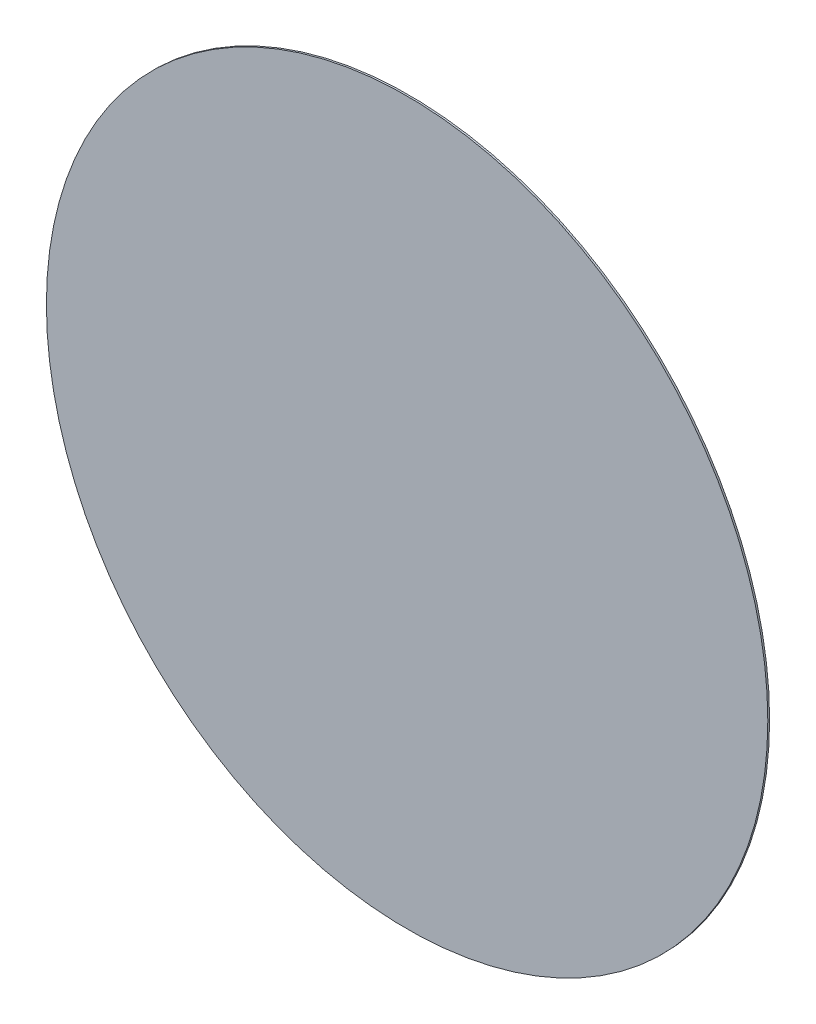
ISO-10303-21;
HEADER;
FILE_DESCRIPTION(('STEP AP214'),'2;1');
FILE_NAME('part.step','',(''),(''),'','','');
FILE_SCHEMA(('AUTOMOTIVE_DESIGN { 1 0 10303 214 1 1 1 1 }'));
ENDSEC;
DATA;
#1=APPLICATION_CONTEXT('core data for automotive mechanical design processes');
#2=APPLICATION_PROTOCOL_DEFINITION('international standard','automotive_design',2000,#1);
#3=PRODUCT_CONTEXT('',#1,'mechanical');
#4=PRODUCT('Part','Part','',(#3));
#5=PRODUCT_RELATED_PRODUCT_CATEGORY('part','',(#4));
#6=PRODUCT_DEFINITION_FORMATION('','',#4);
#7=PRODUCT_DEFINITION_CONTEXT('part definition',#1,'design');
#8=PRODUCT_DEFINITION('design','',#6,#7);
#9=PRODUCT_DEFINITION_SHAPE('','',#8);
#10=(LENGTH_UNIT() NAMED_UNIT(*) SI_UNIT(.MILLI.,.METRE.));
#11=(NAMED_UNIT(*) PLANE_ANGLE_UNIT() SI_UNIT($,.RADIAN.));
#12=(NAMED_UNIT(*) SI_UNIT($,.STERADIAN.) SOLID_ANGLE_UNIT());
#13=UNCERTAINTY_MEASURE_WITH_UNIT(LENGTH_MEASURE(1.E-05),#10,'distance_accuracy_value','');
#14=(GEOMETRIC_REPRESENTATION_CONTEXT(3) GLOBAL_UNCERTAINTY_ASSIGNED_CONTEXT((#13)) GLOBAL_UNIT_ASSIGNED_CONTEXT((#10,
#11,#12)) REPRESENTATION_CONTEXT('',''));
#15=CARTESIAN_POINT('',(0.,0.,0.));
#16=DIRECTION('',(0.,0.,1.));
#17=DIRECTION('',(1.,0.,0.));
#18=AXIS2_PLACEMENT_3D('',#15,#16,#17);
#19=CARTESIAN_POINT('',(-465.937225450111,-349.960393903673,-154.0047981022));
#20=DIRECTION('',(0.,0.,1.));
#21=DIRECTION('',(1.,0.,0.));
#22=AXIS2_PLACEMENT_3D('',#19,#20,#21);
#23=PLANE('',#22);
#24=DIRECTION('',(0.,1.,0.));
#25=VECTOR('',#24,1.);
#26=CARTESIAN_POINT('',(-465.187225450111,-343.210393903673,-154.0047981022));
#27=LINE('',#26,#25);
#28=CARTESIAN_POINT('',(-465.187225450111,-343.210393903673,-154.0047981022));
#29=VERTEX_POINT('',#28);
#30=CARTESIAN_POINT('',(-465.187225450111,-349.210393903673,-154.0047981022));
#31=VERTEX_POINT('',#30);
#32=EDGE_CURVE('E151',#29,#31,#27,.F.);
#33=ORIENTED_EDGE('',*,*,#32,.T.);
#34=DIRECTION('',(-1.,0.,0.));
#35=VECTOR('',#34,1.);
#36=CARTESIAN_POINT('',(-465.187225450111,-349.210393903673,-154.0047981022));
#37=LINE('',#36,#35);
#38=CARTESIAN_POINT('',(-458.937225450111,-349.210393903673,-154.0047981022));
#39=VERTEX_POINT('',#38);
#40=EDGE_CURVE('E259',#31,#39,#37,.F.);
#41=ORIENTED_EDGE('',*,*,#40,.T.);
#42=DIRECTION('',(0.,1.,0.));
#43=VECTOR('',#42,1.);
#44=CARTESIAN_POINT('',(-458.937225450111,-349.210393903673,-154.0047981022));
#45=LINE('',#44,#43);
#46=CARTESIAN_POINT('',(-458.937225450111,-350.710393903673,-154.0047981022));
#47=VERTEX_POINT('',#46);
#48=EDGE_CURVE('E254',#39,#47,#45,.F.);
#49=ORIENTED_EDGE('',*,*,#48,.T.);
#50=DIRECTION('',(1.,0.,0.));
#51=VECTOR('',#50,1.);
#52=CARTESIAN_POINT('',(-458.937225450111,-350.710393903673,-154.0047981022));
#53=LINE('',#52,#51);
#54=CARTESIAN_POINT('',(-472.937225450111,-350.710393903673,-154.0047981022));
#55=VERTEX_POINT('',#54);
#56=EDGE_CURVE('E249',#47,#55,#53,.F.);
#57=ORIENTED_EDGE('',*,*,#56,.T.);
#58=DIRECTION('',(0.,-1.,0.));
#59=VECTOR('',#58,1.);
#60=CARTESIAN_POINT('',(-472.937225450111,-350.710393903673,-154.0047981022));
#61=LINE('',#60,#59);
#62=CARTESIAN_POINT('',(-472.937225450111,-349.210393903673,-154.0047981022));
#63=VERTEX_POINT('',#62);
#64=EDGE_CURVE('E244',#55,#63,#61,.F.);
#65=ORIENTED_EDGE('',*,*,#64,.T.);
#66=DIRECTION('',(-1.,0.,0.));
#67=VECTOR('',#66,1.);
#68=CARTESIAN_POINT('',(-465.187225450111,-349.210393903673,-154.0047981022));
#69=LINE('',#68,#67);
#70=CARTESIAN_POINT('',(-466.687225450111,-349.210393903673,-154.0047981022));
#71=VERTEX_POINT('',#70);
#72=EDGE_CURVE('E134',#63,#71,#69,.F.);
#73=ORIENTED_EDGE('',*,*,#72,.T.);
#74=DIRECTION('',(0.,-1.,0.));
#75=VECTOR('',#74,1.);
#76=CARTESIAN_POINT('',(-466.687225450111,-349.210393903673,-154.0047981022));
#77=LINE('',#76,#75);
#78=CARTESIAN_POINT('',(-466.687225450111,-343.210393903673,-154.0047981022));
#79=VERTEX_POINT('',#78);
#80=EDGE_CURVE('E131',#71,#79,#77,.F.);
#81=ORIENTED_EDGE('',*,*,#80,.T.);
#82=DIRECTION('',(-1.,0.,0.));
#83=VECTOR('',#82,1.);
#84=CARTESIAN_POINT('',(-466.687225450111,-343.210393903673,-154.0047981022));
#85=LINE('',#84,#83);
#86=EDGE_CURVE('E128',#79,#29,#85,.F.);
#87=ORIENTED_EDGE('',*,*,#86,.T.);
#88=EDGE_LOOP('',(#33,#41,#49,#57,#65,#73,#81,#87));
#89=FACE_BOUND('',#88,.T.);
#90=ADVANCED_FACE('F17',(#89),#23,.F.);
#91=CARTESIAN_POINT('',(-465.937225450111,-349.960393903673,-154.0047981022));
#92=DIRECTION('',(0.,0.,1.));
#93=DIRECTION('',(1.,0.,0.));
#94=AXIS2_PLACEMENT_3D('',#91,#92,#93);
#95=PLANE('',#94);
#96=DIRECTION('',(1.,0.,0.));
#97=VECTOR('',#96,1.);
#98=CARTESIAN_POINT('',(-464.187225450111,-356.910393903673,-154.0047981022));
#99=LINE('',#98,#97);
#100=CARTESIAN_POINT('',(-464.187225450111,-356.910393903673,-154.0047981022));
#101=VERTEX_POINT('',#100);
#102=CARTESIAN_POINT('',(-467.687225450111,-356.910393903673,-154.0047981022));
#103=VERTEX_POINT('',#102);
#104=EDGE_CURVE('E231',#101,#103,#99,.F.);
#105=ORIENTED_EDGE('',*,*,#104,.T.);
#106=DIRECTION('',(0.,-1.,0.));
#107=VECTOR('',#106,1.);
#108=CARTESIAN_POINT('',(-467.687225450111,-356.910393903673,-154.0047981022));
#109=LINE('',#108,#107);
#110=CARTESIAN_POINT('',(-467.687225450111,-355.410393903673,-154.0047981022));
#111=VERTEX_POINT('',#110);
#112=EDGE_CURVE('E226',#103,#111,#109,.F.);
#113=ORIENTED_EDGE('',*,*,#112,.T.);
#114=DIRECTION('',(-1.,0.,0.));
#115=VECTOR('',#114,1.);
#116=CARTESIAN_POINT('',(-467.687225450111,-355.410393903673,-154.0047981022));
#117=LINE('',#116,#115);
#118=CARTESIAN_POINT('',(-464.187225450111,-355.410393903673,-154.0047981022));
#119=VERTEX_POINT('',#118);
#120=EDGE_CURVE('E221',#111,#119,#117,.F.);
#121=ORIENTED_EDGE('',*,*,#120,.T.);
#122=DIRECTION('',(0.,1.,0.));
#123=VECTOR('',#122,1.);
#124=CARTESIAN_POINT('',(-464.187225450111,-355.410393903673,-154.0047981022));
#125=LINE('',#124,#123);
#126=EDGE_CURVE('E236',#119,#101,#125,.F.);
#127=ORIENTED_EDGE('',*,*,#126,.T.);
#128=EDGE_LOOP('',(#105,#113,#121,#127));
#129=FACE_BOUND('',#128,.T.);
#130=ADVANCED_FACE('F551',(#129),#95,.F.);
#131=CARTESIAN_POINT('',(-465.937225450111,-349.960393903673,-154.0047981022));
#132=DIRECTION('',(0.,0.,1.));
#133=DIRECTION('',(1.,0.,0.));
#134=AXIS2_PLACEMENT_3D('',#131,#132,#133);
#135=PLANE('',#134);
#136=DIRECTION('',(1.,0.,0.));
#137=VECTOR('',#136,1.);
#138=CARTESIAN_POINT('',(-460.937225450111,-353.810393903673,-154.0047981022));
#139=LINE('',#138,#137);
#140=CARTESIAN_POINT('',(-460.937225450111,-353.810393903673,-154.0047981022));
#141=VERTEX_POINT('',#140);
#142=CARTESIAN_POINT('',(-470.937225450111,-353.810393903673,-154.0047981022));
#143=VERTEX_POINT('',#142);
#144=EDGE_CURVE('E212',#141,#143,#139,.F.);
#145=ORIENTED_EDGE('',*,*,#144,.T.);
#146=DIRECTION('',(0.,-1.,0.));
#147=VECTOR('',#146,1.);
#148=CARTESIAN_POINT('',(-470.937225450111,-353.810393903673,-154.0047981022));
#149=LINE('',#148,#147);
#150=CARTESIAN_POINT('',(-470.937225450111,-352.310393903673,-154.0047981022));
#151=VERTEX_POINT('',#150);
#152=EDGE_CURVE('E207',#143,#151,#149,.F.);
#153=ORIENTED_EDGE('',*,*,#152,.T.);
#154=DIRECTION('',(-1.,0.,0.));
#155=VECTOR('',#154,1.);
#156=CARTESIAN_POINT('',(-470.937225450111,-352.310393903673,-154.0047981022));
#157=LINE('',#156,#155);
#158=CARTESIAN_POINT('',(-460.937225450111,-352.310393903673,-154.0047981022));
#159=VERTEX_POINT('',#158);
#160=EDGE_CURVE('E203',#151,#159,#157,.F.);
#161=ORIENTED_EDGE('',*,*,#160,.T.);
#162=DIRECTION('',(0.,1.,0.));
#163=VECTOR('',#162,1.);
#164=CARTESIAN_POINT('',(-460.937225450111,-352.310393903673,-154.0047981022));
#165=LINE('',#164,#163);
#166=EDGE_CURVE('E217',#159,#141,#165,.F.);
#167=ORIENTED_EDGE('',*,*,#166,.T.);
#168=EDGE_LOOP('',(#145,#153,#161,#167));
#169=FACE_BOUND('',#168,.T.);
#170=ADVANCED_FACE('F540',(#169),#135,.F.);
#171=CARTESIAN_POINT('',(-466.687225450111,-349.210393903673,-182.339246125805));
#172=DIRECTION('',(-1.,0.,0.));
#173=DIRECTION('',(0.,-1.,0.));
#174=AXIS2_PLACEMENT_3D('',#171,#172,#173);
#175=PLANE('',#174);
#176=DIRECTION('',(0.,0.,1.));
#177=VECTOR('',#176,1.);
#178=CARTESIAN_POINT('',(-466.687225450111,-343.210393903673,-182.339246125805));
#179=LINE('',#178,#177);
#180=CARTESIAN_POINT('',(-466.687225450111,-343.210393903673,-154.0547981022));
#181=VERTEX_POINT('',#180);
#182=EDGE_CURVE('E137',#181,#79,#179,.T.);
#183=ORIENTED_EDGE('',*,*,#182,.T.);
#184=ORIENTED_EDGE('',*,*,#80,.F.);
#185=DIRECTION('',(0.,0.,1.));
#186=VECTOR('',#185,1.);
#187=CARTESIAN_POINT('',(-466.687225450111,-349.210393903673,-182.339246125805));
#188=LINE('',#187,#186);
#189=CARTESIAN_POINT('',(-466.687225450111,-349.210393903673,-154.0547981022));
#190=VERTEX_POINT('',#189);
#191=EDGE_CURVE('E238',#71,#190,#188,.F.);
#192=ORIENTED_EDGE('',*,*,#191,.T.);
#193=DIRECTION('',(0.,1.,0.));
#194=VECTOR('',#193,1.);
#195=CARTESIAN_POINT('',(-466.687225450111,-349.960393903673,-154.0547981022));
#196=LINE('',#195,#194);
#197=EDGE_CURVE('E142',#190,#181,#196,.T.);
#198=ORIENTED_EDGE('',*,*,#197,.T.);
#199=EDGE_LOOP('',(#183,#184,#192,#198));
#200=FACE_BOUND('',#199,.T.);
#201=ADVANCED_FACE('F140',(#200),#175,.F.);
#202=CARTESIAN_POINT('',(-466.687225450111,-343.210393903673,-182.339246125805));
#203=DIRECTION('',(0.,1.,0.));
#204=DIRECTION('',(-1.,0.,0.));
#205=AXIS2_PLACEMENT_3D('',#202,#203,#204);
#206=PLANE('',#205);
#207=DIRECTION('',(0.,0.,1.));
#208=VECTOR('',#207,1.);
#209=CARTESIAN_POINT('',(-465.187225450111,-343.210393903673,-182.339246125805));
#210=LINE('',#209,#208);
#211=CARTESIAN_POINT('',(-465.187225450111,-343.210393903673,-154.0547981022));
#212=VERTEX_POINT('',#211);
#213=EDGE_CURVE('E148',#212,#29,#210,.T.);
#214=ORIENTED_EDGE('',*,*,#213,.T.);
#215=ORIENTED_EDGE('',*,*,#86,.F.);
#216=ORIENTED_EDGE('',*,*,#182,.F.);
#217=DIRECTION('',(1.,0.,0.));
#218=VECTOR('',#217,1.);
#219=CARTESIAN_POINT('',(-465.937225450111,-343.210393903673,-154.0547981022));
#220=LINE('',#219,#218);
#221=EDGE_CURVE('E198',#181,#212,#220,.T.);
#222=ORIENTED_EDGE('',*,*,#221,.T.);
#223=EDGE_LOOP('',(#214,#215,#216,#222));
#224=FACE_BOUND('',#223,.T.);
#225=ADVANCED_FACE('F146',(#224),#206,.F.);
#226=CARTESIAN_POINT('',(-465.187225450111,-343.210393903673,-182.339246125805));
#227=DIRECTION('',(1.,0.,0.));
#228=DIRECTION('',(0.,1.,0.));
#229=AXIS2_PLACEMENT_3D('',#226,#227,#228);
#230=PLANE('',#229);
#231=DIRECTION('',(0.,0.,1.));
#232=VECTOR('',#231,1.);
#233=CARTESIAN_POINT('',(-465.187225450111,-349.210393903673,-182.339246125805));
#234=LINE('',#233,#232);
#235=CARTESIAN_POINT('',(-465.187225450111,-349.210393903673,-154.0547981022));
#236=VERTEX_POINT('',#235);
#237=EDGE_CURVE('E261',#236,#31,#234,.T.);
#238=ORIENTED_EDGE('',*,*,#237,.T.);
#239=ORIENTED_EDGE('',*,*,#32,.F.);
#240=ORIENTED_EDGE('',*,*,#213,.F.);
#241=DIRECTION('',(0.,1.,0.));
#242=VECTOR('',#241,1.);
#243=CARTESIAN_POINT('',(-465.187225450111,-349.960393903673,-154.0547981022));
#244=LINE('',#243,#242);
#245=EDGE_CURVE('E196',#212,#236,#244,.F.);
#246=ORIENTED_EDGE('',*,*,#245,.T.);
#247=EDGE_LOOP('',(#238,#239,#240,#246));
#248=FACE_BOUND('',#247,.T.);
#249=ADVANCED_FACE('F266',(#248),#230,.F.);
#250=CARTESIAN_POINT('',(-465.187225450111,-349.210393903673,-182.339246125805));
#251=DIRECTION('',(0.,1.,0.));
#252=DIRECTION('',(-1.,0.,0.));
#253=AXIS2_PLACEMENT_3D('',#250,#251,#252);
#254=PLANE('',#253);
#255=DIRECTION('',(0.,0.,1.));
#256=VECTOR('',#255,1.);
#257=CARTESIAN_POINT('',(-458.937225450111,-349.210393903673,-182.339246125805));
#258=LINE('',#257,#256);
#259=CARTESIAN_POINT('',(-458.937225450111,-349.210393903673,-154.0547981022));
#260=VERTEX_POINT('',#259);
#261=EDGE_CURVE('E256',#260,#39,#258,.T.);
#262=ORIENTED_EDGE('',*,*,#261,.T.);
#263=ORIENTED_EDGE('',*,*,#40,.F.);
#264=ORIENTED_EDGE('',*,*,#237,.F.);
#265=DIRECTION('',(1.,0.,0.));
#266=VECTOR('',#265,1.);
#267=CARTESIAN_POINT('',(-465.937225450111,-349.210393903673,-154.0547981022));
#268=LINE('',#267,#266);
#269=EDGE_CURVE('E194',#236,#260,#268,.T.);
#270=ORIENTED_EDGE('',*,*,#269,.T.);
#271=EDGE_LOOP('',(#262,#263,#264,#270));
#272=FACE_BOUND('',#271,.T.);
#273=ADVANCED_FACE('F270',(#272),#254,.F.);
#274=CARTESIAN_POINT('',(-458.937225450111,-349.210393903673,-182.339246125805));
#275=DIRECTION('',(1.,0.,0.));
#276=DIRECTION('',(0.,1.,0.));
#277=AXIS2_PLACEMENT_3D('',#274,#275,#276);
#278=PLANE('',#277);
#279=DIRECTION('',(0.,0.,1.));
#280=VECTOR('',#279,1.);
#281=CARTESIAN_POINT('',(-458.937225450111,-350.710393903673,-182.339246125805));
#282=LINE('',#281,#280);
#283=CARTESIAN_POINT('',(-458.937225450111,-350.710393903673,-154.0547981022));
#284=VERTEX_POINT('',#283);
#285=EDGE_CURVE('E251',#284,#47,#282,.T.);
#286=ORIENTED_EDGE('',*,*,#285,.T.);
#287=ORIENTED_EDGE('',*,*,#48,.F.);
#288=ORIENTED_EDGE('',*,*,#261,.F.);
#289=DIRECTION('',(0.,1.,0.));
#290=VECTOR('',#289,1.);
#291=CARTESIAN_POINT('',(-458.937225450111,-349.960393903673,-154.0547981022));
#292=LINE('',#291,#290);
#293=EDGE_CURVE('E192',#260,#284,#292,.F.);
#294=ORIENTED_EDGE('',*,*,#293,.T.);
#295=EDGE_LOOP('',(#286,#287,#288,#294));
#296=FACE_BOUND('',#295,.T.);
#297=ADVANCED_FACE('F275',(#296),#278,.F.);
#298=CARTESIAN_POINT('',(-458.937225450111,-350.710393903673,-182.339246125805));
#299=DIRECTION('',(0.,-1.,0.));
#300=DIRECTION('',(1.,0.,0.));
#301=AXIS2_PLACEMENT_3D('',#298,#299,#300);
#302=PLANE('',#301);
#303=DIRECTION('',(0.,0.,1.));
#304=VECTOR('',#303,1.);
#305=CARTESIAN_POINT('',(-472.937225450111,-350.710393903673,-182.339246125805));
#306=LINE('',#305,#304);
#307=CARTESIAN_POINT('',(-472.937225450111,-350.710393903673,-154.0547981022));
#308=VERTEX_POINT('',#307);
#309=EDGE_CURVE('E246',#308,#55,#306,.T.);
#310=ORIENTED_EDGE('',*,*,#309,.T.);
#311=ORIENTED_EDGE('',*,*,#56,.F.);
#312=ORIENTED_EDGE('',*,*,#285,.F.);
#313=DIRECTION('',(1.,0.,0.));
#314=VECTOR('',#313,1.);
#315=CARTESIAN_POINT('',(-465.937225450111,-350.710393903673,-154.0547981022));
#316=LINE('',#315,#314);
#317=EDGE_CURVE('E190',#284,#308,#316,.F.);
#318=ORIENTED_EDGE('',*,*,#317,.T.);
#319=EDGE_LOOP('',(#310,#311,#312,#318));
#320=FACE_BOUND('',#319,.T.);
#321=ADVANCED_FACE('F281',(#320),#302,.F.);
#322=CARTESIAN_POINT('',(-472.937225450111,-350.710393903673,-182.339246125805));
#323=DIRECTION('',(-1.,0.,0.));
#324=DIRECTION('',(0.,-1.,0.));
#325=AXIS2_PLACEMENT_3D('',#322,#323,#324);
#326=PLANE('',#325);
#327=DIRECTION('',(0.,0.,1.));
#328=VECTOR('',#327,1.);
#329=CARTESIAN_POINT('',(-472.937225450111,-349.210393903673,-182.339246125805));
#330=LINE('',#329,#328);
#331=CARTESIAN_POINT('',(-472.937225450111,-349.210393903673,-154.0547981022));
#332=VERTEX_POINT('',#331);
#333=EDGE_CURVE('E241',#332,#63,#330,.T.);
#334=ORIENTED_EDGE('',*,*,#333,.T.);
#335=ORIENTED_EDGE('',*,*,#64,.F.);
#336=ORIENTED_EDGE('',*,*,#309,.F.);
#337=DIRECTION('',(0.,1.,0.));
#338=VECTOR('',#337,1.);
#339=CARTESIAN_POINT('',(-472.937225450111,-349.960393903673,-154.0547981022));
#340=LINE('',#339,#338);
#341=EDGE_CURVE('E188',#308,#332,#340,.T.);
#342=ORIENTED_EDGE('',*,*,#341,.T.);
#343=EDGE_LOOP('',(#334,#335,#336,#342));
#344=FACE_BOUND('',#343,.T.);
#345=ADVANCED_FACE('F285',(#344),#326,.F.);
#346=CARTESIAN_POINT('',(-465.187225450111,-349.210393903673,-182.339246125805));
#347=DIRECTION('',(0.,1.,0.));
#348=DIRECTION('',(-1.,0.,0.));
#349=AXIS2_PLACEMENT_3D('',#346,#347,#348);
#350=PLANE('',#349);
#351=ORIENTED_EDGE('',*,*,#191,.F.);
#352=ORIENTED_EDGE('',*,*,#72,.F.);
#353=ORIENTED_EDGE('',*,*,#333,.F.);
#354=DIRECTION('',(1.,0.,0.));
#355=VECTOR('',#354,1.);
#356=CARTESIAN_POINT('',(-465.937225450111,-349.210393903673,-154.0547981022));
#357=LINE('',#356,#355);
#358=EDGE_CURVE('E185',#332,#190,#357,.T.);
#359=ORIENTED_EDGE('',*,*,#358,.T.);
#360=EDGE_LOOP('',(#351,#352,#353,#359));
#361=FACE_BOUND('',#360,.T.);
#362=ADVANCED_FACE('F289',(#361),#350,.F.);
#363=CARTESIAN_POINT('',(-464.187225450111,-355.410393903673,-182.339246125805));
#364=DIRECTION('',(1.,0.,0.));
#365=DIRECTION('',(0.,1.,0.));
#366=AXIS2_PLACEMENT_3D('',#363,#364,#365);
#367=PLANE('',#366);
#368=DIRECTION('',(0.,0.,1.));
#369=VECTOR('',#368,1.);
#370=CARTESIAN_POINT('',(-464.187225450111,-356.910393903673,-182.339246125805));
#371=LINE('',#370,#369);
#372=CARTESIAN_POINT('',(-464.187225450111,-356.910393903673,-154.0547981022));
#373=VERTEX_POINT('',#372);
#374=EDGE_CURVE('E233',#373,#101,#371,.T.);
#375=ORIENTED_EDGE('',*,*,#374,.T.);
#376=ORIENTED_EDGE('',*,*,#126,.F.);
#377=DIRECTION('',(0.,0.,1.));
#378=VECTOR('',#377,1.);
#379=CARTESIAN_POINT('',(-464.187225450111,-355.410393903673,-182.339246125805));
#380=LINE('',#379,#378);
#381=CARTESIAN_POINT('',(-464.187225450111,-355.410393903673,-154.0547981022));
#382=VERTEX_POINT('',#381);
#383=EDGE_CURVE('E219',#119,#382,#380,.F.);
#384=ORIENTED_EDGE('',*,*,#383,.T.);
#385=DIRECTION('',(0.,1.,0.));
#386=VECTOR('',#385,1.);
#387=CARTESIAN_POINT('',(-464.187225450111,-349.960393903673,-154.0547981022));
#388=LINE('',#387,#386);
#389=EDGE_CURVE('E183',#382,#373,#388,.F.);
#390=ORIENTED_EDGE('',*,*,#389,.T.);
#391=EDGE_LOOP('',(#375,#376,#384,#390));
#392=FACE_BOUND('',#391,.T.);
#393=ADVANCED_FACE('F447',(#392),#367,.F.);
#394=CARTESIAN_POINT('',(-464.187225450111,-356.910393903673,-182.339246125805));
#395=DIRECTION('',(0.,-1.,0.));
#396=DIRECTION('',(1.,0.,0.));
#397=AXIS2_PLACEMENT_3D('',#394,#395,#396);
#398=PLANE('',#397);
#399=DIRECTION('',(0.,0.,1.));
#400=VECTOR('',#399,1.);
#401=CARTESIAN_POINT('',(-467.687225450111,-356.910393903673,-182.339246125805));
#402=LINE('',#401,#400);
#403=CARTESIAN_POINT('',(-467.687225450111,-356.910393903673,-154.0547981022));
#404=VERTEX_POINT('',#403);
#405=EDGE_CURVE('E228',#404,#103,#402,.T.);
#406=ORIENTED_EDGE('',*,*,#405,.T.);
#407=ORIENTED_EDGE('',*,*,#104,.F.);
#408=ORIENTED_EDGE('',*,*,#374,.F.);
#409=DIRECTION('',(1.,0.,0.));
#410=VECTOR('',#409,1.);
#411=CARTESIAN_POINT('',(-465.937225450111,-356.910393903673,-154.0547981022));
#412=LINE('',#411,#410);
#413=EDGE_CURVE('E181',#373,#404,#412,.F.);
#414=ORIENTED_EDGE('',*,*,#413,.T.);
#415=EDGE_LOOP('',(#406,#407,#408,#414));
#416=FACE_BOUND('',#415,.T.);
#417=ADVANCED_FACE('F435',(#416),#398,.F.);
#418=CARTESIAN_POINT('',(-467.687225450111,-356.910393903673,-182.339246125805));
#419=DIRECTION('',(-1.,0.,0.));
#420=DIRECTION('',(0.,-1.,0.));
#421=AXIS2_PLACEMENT_3D('',#418,#419,#420);
#422=PLANE('',#421);
#423=DIRECTION('',(0.,0.,1.));
#424=VECTOR('',#423,1.);
#425=CARTESIAN_POINT('',(-467.687225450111,-355.410393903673,-182.339246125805));
#426=LINE('',#425,#424);
#427=CARTESIAN_POINT('',(-467.687225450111,-355.410393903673,-154.0547981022));
#428=VERTEX_POINT('',#427);
#429=EDGE_CURVE('E223',#428,#111,#426,.T.);
#430=ORIENTED_EDGE('',*,*,#429,.T.);
#431=ORIENTED_EDGE('',*,*,#112,.F.);
#432=ORIENTED_EDGE('',*,*,#405,.F.);
#433=DIRECTION('',(0.,1.,0.));
#434=VECTOR('',#433,1.);
#435=CARTESIAN_POINT('',(-467.687225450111,-349.960393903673,-154.0547981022));
#436=LINE('',#435,#434);
#437=EDGE_CURVE('E179',#404,#428,#436,.T.);
#438=ORIENTED_EDGE('',*,*,#437,.T.);
#439=EDGE_LOOP('',(#430,#431,#432,#438));
#440=FACE_BOUND('',#439,.T.);
#441=ADVANCED_FACE('F423',(#440),#422,.F.);
#442=CARTESIAN_POINT('',(-467.687225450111,-355.410393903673,-182.339246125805));
#443=DIRECTION('',(0.,1.,0.));
#444=DIRECTION('',(-1.,0.,0.));
#445=AXIS2_PLACEMENT_3D('',#442,#443,#444);
#446=PLANE('',#445);
#447=ORIENTED_EDGE('',*,*,#383,.F.);
#448=ORIENTED_EDGE('',*,*,#120,.F.);
#449=ORIENTED_EDGE('',*,*,#429,.F.);
#450=DIRECTION('',(1.,0.,0.));
#451=VECTOR('',#450,1.);
#452=CARTESIAN_POINT('',(-465.937225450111,-355.410393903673,-154.0547981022));
#453=LINE('',#452,#451);
#454=EDGE_CURVE('E176',#428,#382,#453,.T.);
#455=ORIENTED_EDGE('',*,*,#454,.T.);
#456=EDGE_LOOP('',(#447,#448,#449,#455));
#457=FACE_BOUND('',#456,.T.);
#458=ADVANCED_FACE('F411',(#457),#446,.F.);
#459=CARTESIAN_POINT('',(-460.937225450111,-352.310393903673,-182.339246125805));
#460=DIRECTION('',(1.,0.,0.));
#461=DIRECTION('',(0.,1.,0.));
#462=AXIS2_PLACEMENT_3D('',#459,#460,#461);
#463=PLANE('',#462);
#464=DIRECTION('',(0.,0.,1.));
#465=VECTOR('',#464,1.);
#466=CARTESIAN_POINT('',(-460.937225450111,-353.810393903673,-182.339246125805));
#467=LINE('',#466,#465);
#468=CARTESIAN_POINT('',(-460.937225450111,-353.810393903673,-154.0547981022));
#469=VERTEX_POINT('',#468);
#470=EDGE_CURVE('E214',#469,#141,#467,.T.);
#471=ORIENTED_EDGE('',*,*,#470,.T.);
#472=ORIENTED_EDGE('',*,*,#166,.F.);
#473=DIRECTION('',(0.,0.,1.));
#474=VECTOR('',#473,1.);
#475=CARTESIAN_POINT('',(-460.937225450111,-352.310393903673,-182.339246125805));
#476=LINE('',#475,#474);
#477=CARTESIAN_POINT('',(-460.937225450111,-352.310393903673,-154.0547981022));
#478=VERTEX_POINT('',#477);
#479=EDGE_CURVE('E201',#159,#478,#476,.F.);
#480=ORIENTED_EDGE('',*,*,#479,.T.);
#481=DIRECTION('',(0.,1.,0.));
#482=VECTOR('',#481,1.);
#483=CARTESIAN_POINT('',(-460.937225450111,-349.960393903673,-154.0547981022));
#484=LINE('',#483,#482);
#485=EDGE_CURVE('E174',#478,#469,#484,.F.);
#486=ORIENTED_EDGE('',*,*,#485,.T.);
#487=EDGE_LOOP('',(#471,#472,#480,#486));
#488=FACE_BOUND('',#487,.T.);
#489=ADVANCED_FACE('F399',(#488),#463,.F.);
#490=CARTESIAN_POINT('',(-460.937225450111,-353.810393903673,-182.339246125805));
#491=DIRECTION('',(0.,-1.,0.));
#492=DIRECTION('',(1.,0.,0.));
#493=AXIS2_PLACEMENT_3D('',#490,#491,#492);
#494=PLANE('',#493);
#495=DIRECTION('',(0.,0.,1.));
#496=VECTOR('',#495,1.);
#497=CARTESIAN_POINT('',(-470.937225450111,-353.810393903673,-182.339246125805));
#498=LINE('',#497,#496);
#499=CARTESIAN_POINT('',(-470.937225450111,-353.810393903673,-154.0547981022));
#500=VERTEX_POINT('',#499);
#501=EDGE_CURVE('E209',#500,#143,#498,.T.);
#502=ORIENTED_EDGE('',*,*,#501,.T.);
#503=ORIENTED_EDGE('',*,*,#144,.F.);
#504=ORIENTED_EDGE('',*,*,#470,.F.);
#505=DIRECTION('',(1.,0.,0.));
#506=VECTOR('',#505,1.);
#507=CARTESIAN_POINT('',(-465.937225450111,-353.810393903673,-154.0547981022));
#508=LINE('',#507,#506);
#509=EDGE_CURVE('E170',#469,#500,#508,.F.);
#510=ORIENTED_EDGE('',*,*,#509,.T.);
#511=EDGE_LOOP('',(#502,#503,#504,#510));
#512=FACE_BOUND('',#511,.T.);
#513=ADVANCED_FACE('F388',(#512),#494,.F.);
#514=CARTESIAN_POINT('',(-470.937225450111,-353.810393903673,-182.339246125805));
#515=DIRECTION('',(-1.,0.,0.));
#516=DIRECTION('',(0.,-1.,0.));
#517=AXIS2_PLACEMENT_3D('',#514,#515,#516);
#518=PLANE('',#517);
#519=DIRECTION('',(0.,0.,1.));
#520=VECTOR('',#519,1.);
#521=CARTESIAN_POINT('',(-470.937225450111,-352.310393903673,-182.339246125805));
#522=LINE('',#521,#520);
#523=CARTESIAN_POINT('',(-470.937225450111,-352.310393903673,-154.0547981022));
#524=VERTEX_POINT('',#523);
#525=EDGE_CURVE('E205',#524,#151,#522,.T.);
#526=ORIENTED_EDGE('',*,*,#525,.T.);
#527=ORIENTED_EDGE('',*,*,#152,.F.);
#528=ORIENTED_EDGE('',*,*,#501,.F.);
#529=DIRECTION('',(0.,1.,0.));
#530=VECTOR('',#529,1.);
#531=CARTESIAN_POINT('',(-470.937225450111,-349.960393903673,-154.0547981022));
#532=LINE('',#531,#530);
#533=EDGE_CURVE('E35',#500,#524,#532,.T.);
#534=ORIENTED_EDGE('',*,*,#533,.T.);
#535=EDGE_LOOP('',(#526,#527,#528,#534));
#536=FACE_BOUND('',#535,.T.);
#537=ADVANCED_FACE('F305',(#536),#518,.F.);
#538=CARTESIAN_POINT('',(-470.937225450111,-352.310393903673,-182.339246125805));
#539=DIRECTION('',(0.,1.,0.));
#540=DIRECTION('',(-1.,0.,0.));
#541=AXIS2_PLACEMENT_3D('',#538,#539,#540);
#542=PLANE('',#541);
#543=ORIENTED_EDGE('',*,*,#479,.F.);
#544=ORIENTED_EDGE('',*,*,#160,.F.);
#545=ORIENTED_EDGE('',*,*,#525,.F.);
#546=DIRECTION('',(1.,0.,0.));
#547=VECTOR('',#546,1.);
#548=CARTESIAN_POINT('',(-465.937225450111,-352.310393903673,-154.0547981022));
#549=LINE('',#548,#547);
#550=EDGE_CURVE('E161',#524,#478,#549,.T.);
#551=ORIENTED_EDGE('',*,*,#550,.T.);
#552=EDGE_LOOP('',(#543,#544,#545,#551));
#553=FACE_BOUND('',#552,.T.);
#554=ADVANCED_FACE('F295',(#553),#542,.F.);
#555=CARTESIAN_POINT('',(-465.937225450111,-349.960393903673,-154.0547981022));
#556=DIRECTION('',(0.,0.,1.));
#557=DIRECTION('',(1.,0.,0.));
#558=AXIS2_PLACEMENT_3D('',#555,#556,#557);
#559=PLANE('',#558);
#560=ORIENTED_EDGE('',*,*,#533,.F.);
#561=ORIENTED_EDGE('',*,*,#509,.F.);
#562=ORIENTED_EDGE('',*,*,#485,.F.);
#563=ORIENTED_EDGE('',*,*,#550,.F.);
#564=EDGE_LOOP('',(#560,#561,#562,#563));
#565=FACE_BOUND('',#564,.T.);
#566=ORIENTED_EDGE('',*,*,#437,.F.);
#567=ORIENTED_EDGE('',*,*,#413,.F.);
#568=ORIENTED_EDGE('',*,*,#389,.F.);
#569=ORIENTED_EDGE('',*,*,#454,.F.);
#570=EDGE_LOOP('',(#566,#567,#568,#569));
#571=FACE_BOUND('',#570,.T.);
#572=ORIENTED_EDGE('',*,*,#341,.F.);
#573=ORIENTED_EDGE('',*,*,#317,.F.);
#574=ORIENTED_EDGE('',*,*,#293,.F.);
#575=ORIENTED_EDGE('',*,*,#269,.F.);
#576=ORIENTED_EDGE('',*,*,#245,.F.);
#577=ORIENTED_EDGE('',*,*,#221,.F.);
#578=ORIENTED_EDGE('',*,*,#197,.F.);
#579=ORIENTED_EDGE('',*,*,#358,.F.);
#580=EDGE_LOOP('',(#572,#573,#574,#575,#576,#577,#578,#579));
#581=FACE_BOUND('',#580,.T.);
#582=CARTESIAN_POINT('',(-465.937225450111,-349.960393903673,-154.0547981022));
#583=DIRECTION('',(0.,0.,1.));
#584=DIRECTION('',(1.,0.,0.));
#585=AXIS2_PLACEMENT_3D('',#582,#583,#584);
#586=CIRCLE('',#585,8.5);
#587=CARTESIAN_POINT('',(-457.437225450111,-349.960393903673,-154.0547981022));
#588=VERTEX_POINT('',#587);
#589=EDGE_CURVE('E20',#588,#588,#586,.T.);
#590=ORIENTED_EDGE('',*,*,#589,.F.);
#591=EDGE_LOOP('',(#590));
#592=FACE_BOUND('',#591,.T.);
#593=ADVANCED_FACE('F291',(#565,#571,#581,#592),#559,.F.);
#594=CARTESIAN_POINT('',(-465.937225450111,-349.960393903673,-182.339246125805));
#595=DIRECTION('',(0.,0.,1.));
#596=DIRECTION('',(1.,0.,0.));
#597=AXIS2_PLACEMENT_3D('',#594,#595,#596);
#598=CYLINDRICAL_SURFACE('',#597,8.5);
#599=ORIENTED_EDGE('',*,*,#589,.T.);
#600=EDGE_LOOP('',(#599));
#601=FACE_BOUND('',#600,.T.);
#602=CARTESIAN_POINT('',(-465.937225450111,-349.960393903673,-154.0047981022));
#603=DIRECTION('',(0.,0.,1.));
#604=DIRECTION('',(1.,0.,0.));
#605=AXIS2_PLACEMENT_3D('',#602,#603,#604);
#606=CIRCLE('',#605,8.5);
#607=CARTESIAN_POINT('',(-457.437225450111,-349.960393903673,-154.0047981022));
#608=VERTEX_POINT('',#607);
#609=EDGE_CURVE('E156',#608,#608,#606,.F.);
#610=ORIENTED_EDGE('',*,*,#609,.T.);
#611=EDGE_LOOP('',(#610));
#612=FACE_BOUND('',#611,.T.);
#613=ADVANCED_FACE('F294',(#601,#612),#598,.T.);
#614=CARTESIAN_POINT('',(-465.937225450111,-349.960393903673,-154.0047981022));
#615=DIRECTION('',(0.,0.,1.));
#616=DIRECTION('',(1.,0.,0.));
#617=AXIS2_PLACEMENT_3D('',#614,#615,#616);
#618=PLANE('',#617);
#619=ORIENTED_EDGE('',*,*,#609,.F.);
#620=EDGE_LOOP('',(#619));
#621=FACE_BOUND('',#620,.T.);
#622=CARTESIAN_POINT('',(-465.937225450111,-349.960393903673,-154.0047981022));
#623=DIRECTION('',(0.,0.,1.));
#624=DIRECTION('',(1.,0.,0.));
#625=AXIS2_PLACEMENT_3D('',#622,#623,#624);
#626=CIRCLE('',#625,10.);
#627=CARTESIAN_POINT('',(-455.937225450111,-349.960393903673,-154.0047981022));
#628=VERTEX_POINT('',#627);
#629=EDGE_CURVE('E26',#628,#628,#626,.T.);
#630=ORIENTED_EDGE('',*,*,#629,.F.);
#631=EDGE_LOOP('',(#630));
#632=FACE_BOUND('',#631,.T.);
#633=ADVANCED_FACE('F303',(#621,#632),#618,.F.);
#634=CARTESIAN_POINT('',(-465.937225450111,-349.960393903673,-154.0547981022));
#635=DIRECTION('',(0.,0.,1.));
#636=DIRECTION('',(1.,0.,0.));
#637=AXIS2_PLACEMENT_3D('',#634,#635,#636);
#638=CYLINDRICAL_SURFACE('',#637,10.);
#639=ORIENTED_EDGE('',*,*,#629,.T.);
#640=EDGE_LOOP('',(#639));
#641=FACE_BOUND('',#640,.T.);
#642=CARTESIAN_POINT('',(-465.937225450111,-349.960393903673,-153.9547981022));
#643=DIRECTION('',(0.,0.,1.));
#644=DIRECTION('',(1.,0.,0.));
#645=AXIS2_PLACEMENT_3D('',#642,#643,#644);
#646=CIRCLE('',#645,10.);
#647=CARTESIAN_POINT('',(-455.937225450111,-349.960393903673,-153.9547981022));
#648=VERTEX_POINT('',#647);
#649=EDGE_CURVE('E11',#648,#648,#646,.T.);
#650=ORIENTED_EDGE('',*,*,#649,.F.);
#651=EDGE_LOOP('',(#650));
#652=FACE_BOUND('',#651,.T.);
#653=ADVANCED_FACE('F310',(#641,#652),#638,.T.);
#654=CARTESIAN_POINT('',(-465.937225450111,-349.960393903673,-153.9547981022));
#655=DIRECTION('',(0.,0.,1.));
#656=DIRECTION('',(1.,0.,0.));
#657=AXIS2_PLACEMENT_3D('',#654,#655,#656);
#658=PLANE('',#657);
#659=ORIENTED_EDGE('',*,*,#649,.T.);
#660=EDGE_LOOP('',(#659));
#661=FACE_BOUND('',#660,.T.);
#662=ADVANCED_FACE('F308',(#661),#658,.T.);
#663=CLOSED_SHELL('',(#90,#130,#170,#201,#225,#249,#273,#297,#321,#345,#362,#393,#417,#441,#458,
#489,#513,#537,#554,#593,#613,#633,#653,#662));
#664=MANIFOLD_SOLID_BREP('B1',#663);
#665=ADVANCED_BREP_SHAPE_REPRESENTATION('',(#18,#664),#14);
#666=SHAPE_DEFINITION_REPRESENTATION(#9,#665);
ENDSEC;
END-ISO-10303-21;
